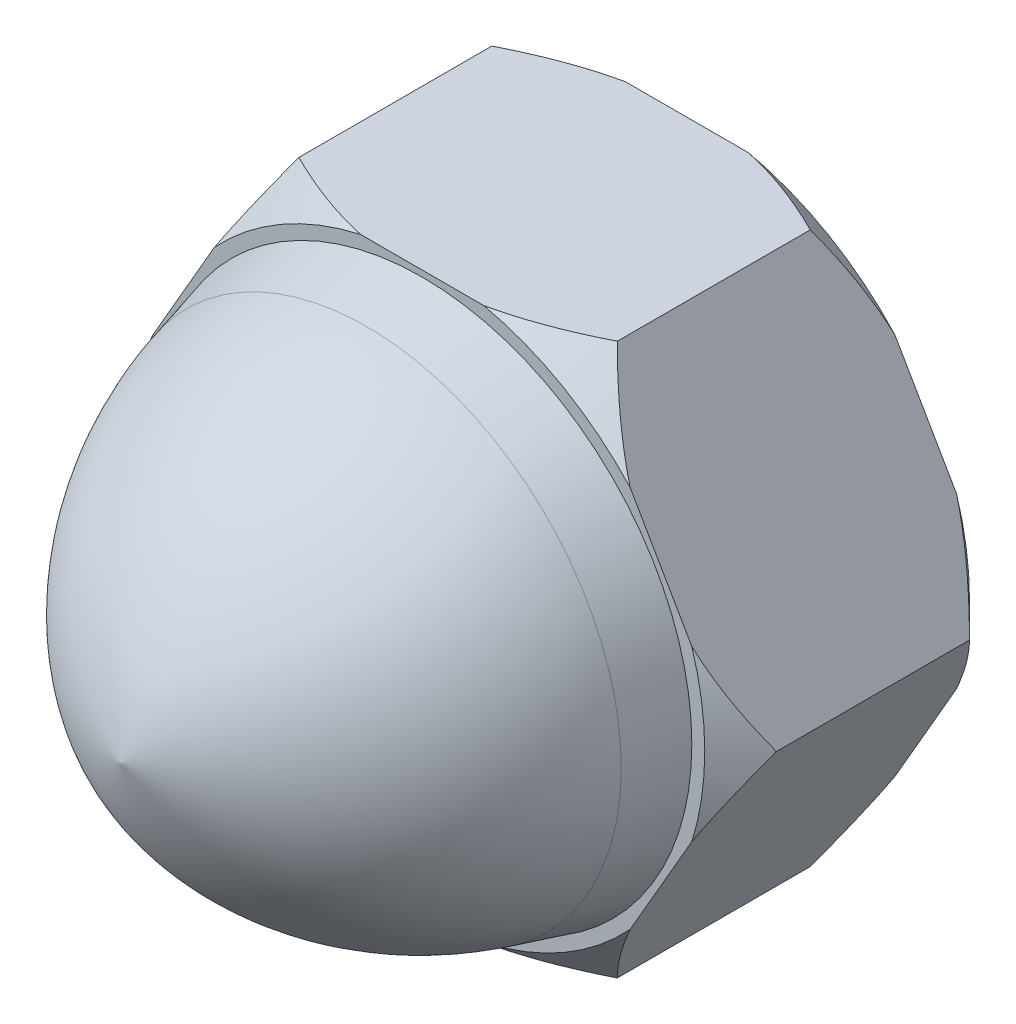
from build123d import *

# Parameters (mm, degrees)
BASE_EXTRUSION_DEPTH    = 4.8
ESQUISSE10_R            = 2.5
COUPER_EXTRUSION1_DEPTH = 6.5


with BuildPart() as part:
    # Esquisse1 → Base-Extrusion (new body)
    with BuildSketch(Plane.XY):
        Polygon((-2.886751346, 5), (2.886751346, 5), (5.773502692, 0), (2.886751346, -5), (-2.886751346, -5), (-5.773502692, 0), align=None)
    extrude(amount=-BASE_EXTRUSION_DEPTH)

    # Couper-Balayage1: sweep along a path in Esquisse3
    with BuildLine(Plane.XY) as couper_balayage1_path:
        CenterArc((0, 0), 4, 0, 360)
    # Esquisse2 → Couper-Balayage1 (sweep, cut)
    with BuildSketch(Plane(origin=(0, 0, 0), x_dir=(1, 0, 0), z_dir=(0, 1, 0))):
        Polygon((5.773502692, 0.65), (5.773502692, 0), (5.123502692, 0), align=None)
    sweep(path=couper_balayage1_path.line, mode=Mode.SUBTRACT)

    # Couper-Balayage2: sweep along a path in Esquisse6
    with BuildLine(Plane(origin=(0, 0, -4.8), x_dir=(-1, 0, 0), z_dir=(0, 0, -1))) as couper_balayage2_path:
        CenterArc((0, 0), 4, 0, 360)
    # Esquisse5 → Couper-Balayage2 (sweep, cut)
    with BuildSketch(Plane(origin=(0, 0, 0), x_dir=(1, 0, 0), z_dir=(0, 1, 0))):
        Polygon((-5.773502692, 4.8), (-5.773502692, 4.15), (-5.123502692, 4.8), align=None)
    sweep(path=couper_balayage2_path.line, mode=Mode.SUBTRACT)

    # Esquisse10 → Couper-Extrusion1 (cut)
    with BuildSketch(Plane(origin=(0, 0, -4.8), x_dir=(-1, 0, 0), z_dir=(0, 0, -1))):
        Circle(ESQUISSE10_R)
    extrude(amount=-COUPER_EXTRUSION1_DEPTH, mode=Mode.SUBTRACT)

    # Bossage-Balayage8: sweep along a path in Esquisse19
    with BuildLine(Plane.XY) as bossage_balayage8_path:
        CenterArc((0, 0), 4.889206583, 0, 360)
    # Esquisse18 → Bossage-Balayage8 (sweep)
    with BuildSketch(Plane(origin=(0, 0, 0), x_dir=(1, 0, 0), z_dir=(0, 1, 0))):
        with BuildLine():
            Line((0, 0), (0, -5.47928434))
            ThreePointArc((0, -5.47928434), (-2.92777579, -3.883783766), (-4.618579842, -1.009992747))
            Line((-4.618579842, -1.009992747), (-4.889206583, 0))
            Line((-4.889206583, 0), (0, 0))
        make_face()
    sweep(path=bossage_balayage8_path.line)


solid = part.part
